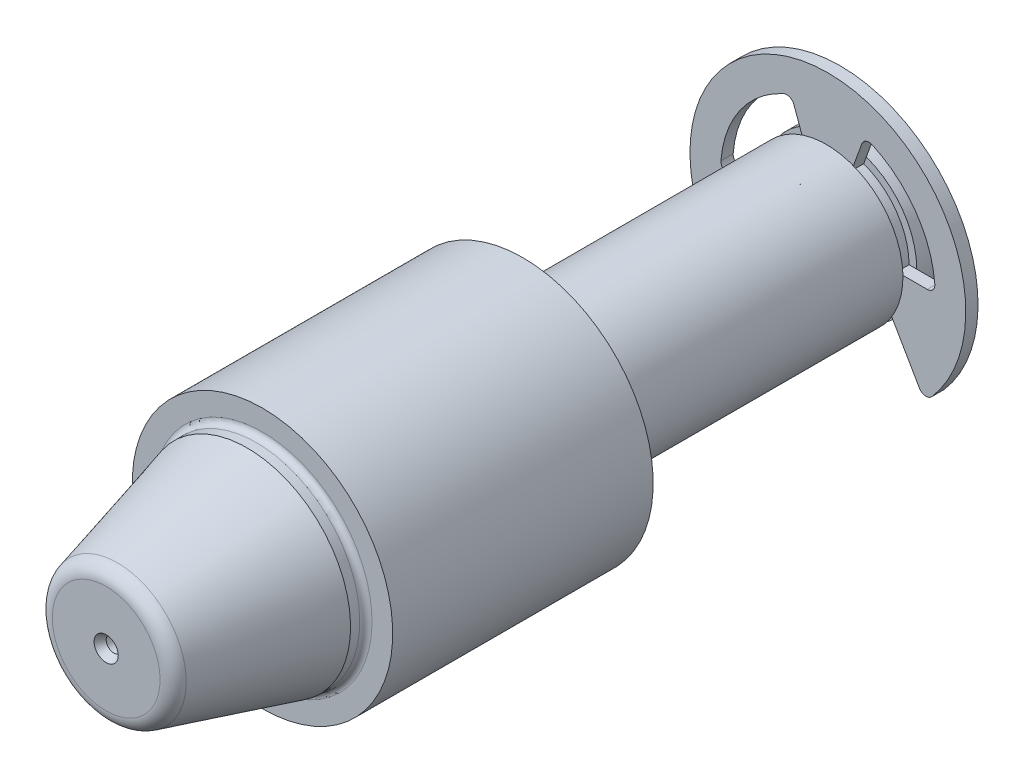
ISO-10303-21;
HEADER;
FILE_DESCRIPTION(('STEP AP214'),'2;1');
FILE_NAME('part.step','',(''),(''),'','','');
FILE_SCHEMA(('AUTOMOTIVE_DESIGN { 1 0 10303 214 1 1 1 1 }'));
ENDSEC;
DATA;
#1=APPLICATION_CONTEXT('core data for automotive mechanical design processes');
#2=APPLICATION_PROTOCOL_DEFINITION('international standard','automotive_design',2000,#1);
#3=PRODUCT_CONTEXT('',#1,'mechanical');
#4=PRODUCT('Part','Part','',(#3));
#5=PRODUCT_RELATED_PRODUCT_CATEGORY('part','',(#4));
#6=PRODUCT_DEFINITION_FORMATION('','',#4);
#7=PRODUCT_DEFINITION_CONTEXT('part definition',#1,'design');
#8=PRODUCT_DEFINITION('design','',#6,#7);
#9=PRODUCT_DEFINITION_SHAPE('','',#8);
#10=(LENGTH_UNIT() NAMED_UNIT(*) SI_UNIT(.MILLI.,.METRE.));
#11=(NAMED_UNIT(*) PLANE_ANGLE_UNIT() SI_UNIT($,.RADIAN.));
#12=(NAMED_UNIT(*) SI_UNIT($,.STERADIAN.) SOLID_ANGLE_UNIT());
#13=UNCERTAINTY_MEASURE_WITH_UNIT(LENGTH_MEASURE(1.E-05),#10,'distance_accuracy_value','');
#14=(GEOMETRIC_REPRESENTATION_CONTEXT(3) GLOBAL_UNCERTAINTY_ASSIGNED_CONTEXT((#13)) GLOBAL_UNIT_ASSIGNED_CONTEXT((#10,
#11,#12)) REPRESENTATION_CONTEXT('',''));
#15=CARTESIAN_POINT('',(0.,0.,0.));
#16=DIRECTION('',(0.,0.,1.));
#17=DIRECTION('',(1.,0.,0.));
#18=AXIS2_PLACEMENT_3D('',#15,#16,#17);
#19=CARTESIAN_POINT('',(0.,0.,26.2));
#20=DIRECTION('',(0.,0.,-1.));
#21=DIRECTION('',(0.,-1.,0.));
#22=AXIS2_PLACEMENT_3D('',#19,#20,#21);
#23=TOROIDAL_SURFACE('',#22,3.51754044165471,1.);
#24=CARTESIAN_POINT('',(0.,0.,26.4588190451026));
#25=DIRECTION('',(0.,0.,-1.));
#26=DIRECTION('',(0.,-1.,0.));
#27=AXIS2_PLACEMENT_3D('',#24,#25,#26);
#28=CIRCLE('',#27,4.48346626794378);
#29=CARTESIAN_POINT('',(0.,-4.48346626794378,26.4588190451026));
#30=VERTEX_POINT('',#29);
#31=EDGE_CURVE('E186',#30,#30,#28,.T.);
#32=ORIENTED_EDGE('',*,*,#31,.F.);
#33=EDGE_LOOP('',(#32));
#34=FACE_BOUND('',#33,.T.);
#35=CARTESIAN_POINT('',(0.,0.,27.2));
#36=DIRECTION('',(0.,0.,-1.));
#37=DIRECTION('',(0.,-1.,0.));
#38=AXIS2_PLACEMENT_3D('',#35,#36,#37);
#39=CIRCLE('',#38,3.51754044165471);
#40=CARTESIAN_POINT('',(0.,-3.51754044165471,27.2));
#41=VERTEX_POINT('',#40);
#42=EDGE_CURVE('E190',#41,#41,#39,.T.);
#43=ORIENTED_EDGE('',*,*,#42,.T.);
#44=EDGE_LOOP('',(#43));
#45=FACE_BOUND('',#44,.T.);
#46=ADVANCED_FACE('F14',(#34,#45),#23,.T.);
#47=CARTESIAN_POINT('',(0.,0.,26.4588190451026));
#48=DIRECTION('',(0.,0.,-1.));
#49=DIRECTION('',(0.,-1.,0.));
#50=AXIS2_PLACEMENT_3D('',#47,#48,#49);
#51=CONICAL_SURFACE('',#50,4.48346626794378,0.26179938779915);
#52=CARTESIAN_POINT('',(0.,0.,18.));
#53=DIRECTION('',(0.,0.,-1.));
#54=DIRECTION('',(0.,-1.,0.));
#55=AXIS2_PLACEMENT_3D('',#52,#53,#54);
#56=CIRCLE('',#55,6.75);
#57=CARTESIAN_POINT('',(0.,-6.75,18.));
#58=VERTEX_POINT('',#57);
#59=EDGE_CURVE('E399',#58,#58,#56,.T.);
#60=ORIENTED_EDGE('',*,*,#59,.F.);
#61=EDGE_LOOP('',(#60));
#62=FACE_BOUND('',#61,.T.);
#63=ORIENTED_EDGE('',*,*,#31,.T.);
#64=EDGE_LOOP('',(#63));
#65=FACE_BOUND('',#64,.T.);
#66=ADVANCED_FACE('F405',(#62,#65),#51,.T.);
#67=CARTESIAN_POINT('',(0.,3.51754044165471,27.2));
#68=DIRECTION('',(0.,0.,-1.));
#69=DIRECTION('',(0.,-1.,0.));
#70=AXIS2_PLACEMENT_3D('',#67,#68,#69);
#71=PLANE('',#70);
#72=CARTESIAN_POINT('',(0.,0.,27.2));
#73=DIRECTION('',(0.,0.,-1.));
#74=DIRECTION('',(0.,-1.,0.));
#75=AXIS2_PLACEMENT_3D('',#72,#73,#74);
#76=CIRCLE('',#75,0.788675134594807);
#77=CARTESIAN_POINT('',(0.,-0.788675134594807,27.2));
#78=VERTEX_POINT('',#77);
#79=EDGE_CURVE('E201',#78,#78,#76,.T.);
#80=ORIENTED_EDGE('',*,*,#79,.T.);
#81=EDGE_LOOP('',(#80));
#82=FACE_BOUND('',#81,.T.);
#83=ORIENTED_EDGE('',*,*,#42,.F.);
#84=EDGE_LOOP('',(#83));
#85=FACE_BOUND('',#84,.T.);
#86=ADVANCED_FACE('F413',(#82,#85),#71,.F.);
#87=CARTESIAN_POINT('',(0.,0.,-23.6077483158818));
#88=DIRECTION('',(0.,0.,-1.));
#89=DIRECTION('',(0.,-1.,0.));
#90=AXIS2_PLACEMENT_3D('',#87,#88,#89);
#91=CYLINDRICAL_SURFACE('',#90,6.75);
#92=CARTESIAN_POINT('',(0.,0.,17.4));
#93=DIRECTION('',(0.,0.,-1.));
#94=DIRECTION('',(0.,-1.,0.));
#95=AXIS2_PLACEMENT_3D('',#92,#93,#94);
#96=CIRCLE('',#95,6.75);
#97=CARTESIAN_POINT('',(0.,-6.75,17.4));
#98=VERTEX_POINT('',#97);
#99=EDGE_CURVE('E213',#98,#98,#96,.F.);
#100=ORIENTED_EDGE('',*,*,#99,.T.);
#101=EDGE_LOOP('',(#100));
#102=FACE_BOUND('',#101,.T.);
#103=ORIENTED_EDGE('',*,*,#59,.T.);
#104=EDGE_LOOP('',(#103));
#105=FACE_BOUND('',#104,.T.);
#106=ADVANCED_FACE('F415',(#102,#105),#91,.T.);
#107=CARTESIAN_POINT('',(0.,0.,26.7));
#108=DIRECTION('',(0.,0.,1.));
#109=DIRECTION('',(0.,1.,0.));
#110=AXIS2_PLACEMENT_3D('',#107,#108,#109);
#111=CONICAL_SURFACE('',#110,0.5,0.523598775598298);
#112=ORIENTED_EDGE('',*,*,#79,.F.);
#113=EDGE_LOOP('',(#112));
#114=FACE_BOUND('',#113,.T.);
#115=CARTESIAN_POINT('',(0.,0.,26.7));
#116=DIRECTION('',(0.,0.,-1.));
#117=DIRECTION('',(0.,-1.,0.));
#118=AXIS2_PLACEMENT_3D('',#115,#116,#117);
#119=CIRCLE('',#118,0.5);
#120=CARTESIAN_POINT('',(0.,-0.5,26.7));
#121=VERTEX_POINT('',#120);
#122=EDGE_CURVE('E198',#121,#121,#119,.F.);
#123=ORIENTED_EDGE('',*,*,#122,.F.);
#124=EDGE_LOOP('',(#123));
#125=FACE_BOUND('',#124,.T.);
#126=ADVANCED_FACE('F424',(#114,#125),#111,.F.);
#127=CARTESIAN_POINT('',(0.,0.,17.4));
#128=DIRECTION('',(0.,0.,-1.));
#129=DIRECTION('',(0.,-1.,0.));
#130=AXIS2_PLACEMENT_3D('',#127,#128,#129);
#131=TOROIDAL_SURFACE('',#130,7.15,0.4);
#132=ORIENTED_EDGE('',*,*,#99,.F.);
#133=EDGE_LOOP('',(#132));
#134=FACE_BOUND('',#133,.T.);
#135=CARTESIAN_POINT('',(0.,0.,17.));
#136=DIRECTION('',(0.,0.,-1.));
#137=DIRECTION('',(0.,-1.,0.));
#138=AXIS2_PLACEMENT_3D('',#135,#136,#137);
#139=CIRCLE('',#138,7.15);
#140=CARTESIAN_POINT('',(0.,-7.15,17.));
#141=VERTEX_POINT('',#140);
#142=EDGE_CURVE('E210',#141,#141,#139,.T.);
#143=ORIENTED_EDGE('',*,*,#142,.F.);
#144=EDGE_LOOP('',(#143));
#145=FACE_BOUND('',#144,.T.);
#146=ADVANCED_FACE('F793',(#134,#145),#131,.F.);
#147=CARTESIAN_POINT('',(0.,0.,17.2));
#148=DIRECTION('',(0.,0.,1.));
#149=DIRECTION('',(0.,1.,0.));
#150=AXIS2_PLACEMENT_3D('',#147,#148,#149);
#151=CYLINDRICAL_SURFACE('',#150,0.5);
#152=ORIENTED_EDGE('',*,*,#122,.T.);
#153=EDGE_LOOP('',(#152));
#154=FACE_BOUND('',#153,.T.);
#155=CARTESIAN_POINT('',(0.,0.,23.5317642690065));
#156=DIRECTION('',(0.,0.,-1.));
#157=DIRECTION('',(0.,-1.,0.));
#158=AXIS2_PLACEMENT_3D('',#155,#156,#157);
#159=CIRCLE('',#158,0.5);
#160=CARTESIAN_POINT('',(0.,-0.50000000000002,23.5317642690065));
#161=VERTEX_POINT('',#160);
#162=EDGE_CURVE('E175',#161,#161,#159,.F.);
#163=ORIENTED_EDGE('',*,*,#162,.F.);
#164=EDGE_LOOP('',(#163));
#165=FACE_BOUND('',#164,.T.);
#166=ADVANCED_FACE('F583',(#154,#165),#151,.F.);
#167=CARTESIAN_POINT('',(0.,6.75,17.));
#168=DIRECTION('',(0.,0.,-1.));
#169=DIRECTION('',(0.,-1.,0.));
#170=AXIS2_PLACEMENT_3D('',#167,#168,#169);
#171=PLANE('',#170);
#172=ORIENTED_EDGE('',*,*,#142,.T.);
#173=EDGE_LOOP('',(#172));
#174=FACE_BOUND('',#173,.T.);
#175=CARTESIAN_POINT('',(0.,0.,17.));
#176=DIRECTION('',(0.,0.,-1.));
#177=DIRECTION('',(0.,-1.,0.));
#178=AXIS2_PLACEMENT_3D('',#175,#176,#177);
#179=CIRCLE('',#178,8.5);
#180=CARTESIAN_POINT('',(0.,-8.5,17.));
#181=VERTEX_POINT('',#180);
#182=EDGE_CURVE('E396',#181,#181,#179,.T.);
#183=ORIENTED_EDGE('',*,*,#182,.F.);
#184=EDGE_LOOP('',(#183));
#185=FACE_BOUND('',#184,.T.);
#186=ADVANCED_FACE('F574',(#174,#185),#171,.F.);
#187=CARTESIAN_POINT('',(0.,0.,22.3));
#188=DIRECTION('',(0.,0.,-1.));
#189=DIRECTION('',(0.,-1.,0.));
#190=AXIS2_PLACEMENT_3D('',#187,#188,#189);
#191=CONICAL_SURFACE('',#190,2.55,1.02974425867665);
#192=CARTESIAN_POINT('',(0.,0.,22.3));
#193=DIRECTION('',(0.,0.,-1.));
#194=DIRECTION('',(0.,-1.,0.));
#195=AXIS2_PLACEMENT_3D('',#192,#193,#194);
#196=CIRCLE('',#195,2.55);
#197=CARTESIAN_POINT('',(0.,-2.55,22.3));
#198=VERTEX_POINT('',#197);
#199=EDGE_CURVE('E181',#198,#198,#196,.T.);
#200=CARTESIAN_POINT('',(0.,-0.50000000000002,23.5317642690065));
#201=CARTESIAN_POINT('',(0.,-0.521354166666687,23.5189333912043));
#202=CARTESIAN_POINT('',(0.,-0.542708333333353,23.5061025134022));
#203=CARTESIAN_POINT('',(0.,-0.585416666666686,23.4804407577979));
#204=CARTESIAN_POINT('',(0.,-0.606770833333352,23.4676098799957));
#205=CARTESIAN_POINT('',(0.,-0.649479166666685,23.4419481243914));
#206=CARTESIAN_POINT('',(0.,-0.670833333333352,23.4291172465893));
#207=CARTESIAN_POINT('',(0.,-0.713541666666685,23.403455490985));
#208=CARTESIAN_POINT('',(0.,-0.734895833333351,23.3906246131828));
#209=CARTESIAN_POINT('',(0.,-0.777604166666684,23.3649628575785));
#210=CARTESIAN_POINT('',(0.,-0.79895833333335,23.3521319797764));
#211=CARTESIAN_POINT('',(0.,-0.841666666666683,23.3264702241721));
#212=CARTESIAN_POINT('',(0.,-0.86302083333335,23.3136393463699));
#213=CARTESIAN_POINT('',(0.,-0.905729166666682,23.2879775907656));
#214=CARTESIAN_POINT('',(0.,-0.927083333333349,23.2751467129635));
#215=CARTESIAN_POINT('',(0.,-0.969791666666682,23.2494849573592));
#216=CARTESIAN_POINT('',(0.,-0.991145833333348,23.236654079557));
#217=CARTESIAN_POINT('',(0.,-1.03385416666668,23.2109923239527));
#218=CARTESIAN_POINT('',(0.,-1.05520833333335,23.1981614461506));
#219=CARTESIAN_POINT('',(0.,-1.09791666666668,23.1724996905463));
#220=CARTESIAN_POINT('',(0.,-1.11927083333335,23.1596688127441));
#221=CARTESIAN_POINT('',(0.,-1.16197916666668,23.1340070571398));
#222=CARTESIAN_POINT('',(0.,-1.18333333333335,23.1211761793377));
#223=CARTESIAN_POINT('',(0.,-1.22604166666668,23.0955144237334));
#224=CARTESIAN_POINT('',(0.,-1.24739583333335,23.0826835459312));
#225=CARTESIAN_POINT('',(0.,-1.29010416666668,23.0570217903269));
#226=CARTESIAN_POINT('',(0.,-1.31145833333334,23.0441909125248));
#227=CARTESIAN_POINT('',(0.,-1.35416666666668,23.0185291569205));
#228=CARTESIAN_POINT('',(0.,-1.37552083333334,23.0056982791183));
#229=CARTESIAN_POINT('',(0.,-1.41822916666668,22.980036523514));
#230=CARTESIAN_POINT('',(0.,-1.43958333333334,22.9672056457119));
#231=CARTESIAN_POINT('',(0.,-1.48229166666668,22.9415438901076));
#232=CARTESIAN_POINT('',(0.,-1.50364583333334,22.9287130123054));
#233=CARTESIAN_POINT('',(0.,-1.54635416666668,22.9030512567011));
#234=CARTESIAN_POINT('',(0.,-1.56770833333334,22.8902203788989));
#235=CARTESIAN_POINT('',(0.,-1.61041666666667,22.8645586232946));
#236=CARTESIAN_POINT('',(0.,-1.63177083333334,22.8517277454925));
#237=CARTESIAN_POINT('',(0.,-1.67447916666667,22.8260659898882));
#238=CARTESIAN_POINT('',(0.,-1.69583333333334,22.813235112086));
#239=CARTESIAN_POINT('',(0.,-1.73854166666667,22.7875733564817));
#240=CARTESIAN_POINT('',(0.,-1.75989583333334,22.7747424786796));
#241=CARTESIAN_POINT('',(0.,-1.80260416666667,22.7490807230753));
#242=CARTESIAN_POINT('',(0.,-1.82395833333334,22.7362498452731));
#243=CARTESIAN_POINT('',(0.,-1.86666666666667,22.7105880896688));
#244=CARTESIAN_POINT('',(0.,-1.88802083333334,22.6977572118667));
#245=CARTESIAN_POINT('',(0.,-1.93072916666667,22.6720954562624));
#246=CARTESIAN_POINT('',(0.,-1.95208333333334,22.6592645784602));
#247=CARTESIAN_POINT('',(0.,-1.99479166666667,22.6336028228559));
#248=CARTESIAN_POINT('',(0.,-2.01614583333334,22.6207719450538));
#249=CARTESIAN_POINT('',(0.,-2.05885416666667,22.5951101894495));
#250=CARTESIAN_POINT('',(0.,-2.08020833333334,22.5822793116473));
#251=CARTESIAN_POINT('',(0.,-2.12291666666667,22.556617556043));
#252=CARTESIAN_POINT('',(0.,-2.14427083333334,22.5437866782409));
#253=CARTESIAN_POINT('',(0.,-2.18697916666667,22.5181249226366));
#254=CARTESIAN_POINT('',(0.,-2.20833333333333,22.5052940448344));
#255=CARTESIAN_POINT('',(0.,-2.25104166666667,22.4796322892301));
#256=CARTESIAN_POINT('',(0.,-2.27239583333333,22.466801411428));
#257=CARTESIAN_POINT('',(0.,-2.31510416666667,22.4411396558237));
#258=CARTESIAN_POINT('',(0.,-2.33645833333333,22.4283087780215));
#259=CARTESIAN_POINT('',(0.,-2.37916666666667,22.4026470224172));
#260=CARTESIAN_POINT('',(0.,-2.40052083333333,22.3898161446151));
#261=CARTESIAN_POINT('',(0.,-2.44322916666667,22.3641543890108));
#262=CARTESIAN_POINT('',(0.,-2.46458333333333,22.3513235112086));
#263=CARTESIAN_POINT('',(0.,-2.50729166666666,22.3256617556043));
#264=CARTESIAN_POINT('',(0.,-2.52864583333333,22.3128308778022));
#265=CARTESIAN_POINT('',(0.,-2.55,22.3));
#266=B_SPLINE_CURVE_WITH_KNOTS('',3,(#200,#201,#202,#203,#204,#205,#206,#207,#208,#209,#210,
#211,#212,#213,#214,#215,#216,#217,#218,#219,#220,#221,#222,#223,#224,#225,#226,#227,#228,#229,
#230,#231,#232,#233,#234,#235,#236,#237,#238,#239,#240,#241,#242,#243,#244,#245,#246,#247,#248,
#249,#250,#251,#252,#253,#254,#255,#256,#257,#258,#259,#260,#261,#262,#263,#264,#265),
.UNSPECIFIED.,.F.,.F.,(4,2,2,2,2,2,2,2,2,2,2,2,2,2,2,2,2,2,2,2,2,2,2,2,2,2,2,2,2,2,2,2,4),(0.,
0.0747374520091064,0.149474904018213,0.22421235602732,0.298949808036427,0.373687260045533,
0.44842471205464,0.523162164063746,0.597899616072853,0.67263706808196,0.747374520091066,
0.822111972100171,0.896849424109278,0.971586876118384,1.04632432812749,1.1210617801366,
1.1957992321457,1.27053668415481,1.34527413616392,1.42001158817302,1.49474904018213,
1.56948649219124,1.64422394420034,1.71896139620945,1.79369884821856,1.86843630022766,
1.94317375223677,2.01791120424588,2.09264865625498,2.16738610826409,2.2421235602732,
2.3168610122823,2.39159846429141),.UNSPECIFIED.);
#267=EDGE_CURVE('BSEAM572',#161,#198,#266,.T.);
#268=ORIENTED_EDGE('',*,*,#162,.T.);
#269=ORIENTED_EDGE('',*,*,#199,.T.);
#270=ORIENTED_EDGE('',*,*,#267,.T.);
#271=ORIENTED_EDGE('',*,*,#267,.F.);
#272=EDGE_LOOP('',(#268,#270,#269,#271));
#273=FACE_BOUND('',#272,.T.);
#274=ADVANCED_FACE('F572',(#273),#191,.F.);
#275=CARTESIAN_POINT('',(0.,0.,-23.6077483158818));
#276=DIRECTION('',(0.,0.,-1.));
#277=DIRECTION('',(0.,-1.,0.));
#278=AXIS2_PLACEMENT_3D('',#275,#276,#277);
#279=CYLINDRICAL_SURFACE('',#278,8.5);
#280=CARTESIAN_POINT('',(0.,0.,0.));
#281=DIRECTION('',(0.,0.,-1.));
#282=DIRECTION('',(0.,-1.,0.));
#283=AXIS2_PLACEMENT_3D('',#280,#281,#282);
#284=CIRCLE('',#283,8.5);
#285=CARTESIAN_POINT('',(0.,-8.5,0.));
#286=VERTEX_POINT('',#285);
#287=EDGE_CURVE('E393',#286,#286,#284,.T.);
#288=ORIENTED_EDGE('',*,*,#287,.F.);
#289=EDGE_LOOP('',(#288));
#290=FACE_BOUND('',#289,.T.);
#291=ORIENTED_EDGE('',*,*,#182,.T.);
#292=EDGE_LOOP('',(#291));
#293=FACE_BOUND('',#292,.T.);
#294=ADVANCED_FACE('F568',(#290,#293),#279,.T.);
#295=CARTESIAN_POINT('',(0.,0.,-22.7));
#296=DIRECTION('',(0.,0.,-1.));
#297=DIRECTION('',(0.,-1.,0.));
#298=AXIS2_PLACEMENT_3D('',#295,#296,#297);
#299=CYLINDRICAL_SURFACE('',#298,2.55);
#300=CARTESIAN_POINT('',(0.,0.,-22.2));
#301=DIRECTION('',(0.,0.,1.));
#302=DIRECTION('',(0.,1.,0.));
#303=AXIS2_PLACEMENT_3D('',#300,#301,#302);
#304=CIRCLE('',#303,2.55);
#305=CARTESIAN_POINT('',(0.,2.55,-22.2));
#306=VERTEX_POINT('',#305);
#307=EDGE_CURVE('E192',#306,#306,#304,.F.);
#308=ORIENTED_EDGE('',*,*,#307,.T.);
#309=EDGE_LOOP('',(#308));
#310=FACE_BOUND('',#309,.T.);
#311=ORIENTED_EDGE('',*,*,#199,.F.);
#312=EDGE_LOOP('',(#311));
#313=FACE_BOUND('',#312,.T.);
#314=ADVANCED_FACE('F565',(#310,#313),#299,.F.);
#315=CARTESIAN_POINT('',(0.,5.,0.));
#316=DIRECTION('',(0.,0.,1.));
#317=DIRECTION('',(0.,1.,0.));
#318=AXIS2_PLACEMENT_3D('',#315,#316,#317);
#319=PLANE('',#318);
#320=CARTESIAN_POINT('',(0.,0.,0.));
#321=DIRECTION('',(0.,0.,1.));
#322=DIRECTION('',(0.,1.,0.));
#323=AXIS2_PLACEMENT_3D('',#320,#321,#322);
#324=CIRCLE('',#323,5.4);
#325=CARTESIAN_POINT('',(0.,5.4,0.));
#326=VERTEX_POINT('',#325);
#327=EDGE_CURVE('E207',#326,#326,#324,.T.);
#328=ORIENTED_EDGE('',*,*,#327,.T.);
#329=EDGE_LOOP('',(#328));
#330=FACE_BOUND('',#329,.T.);
#331=ORIENTED_EDGE('',*,*,#287,.T.);
#332=EDGE_LOOP('',(#331));
#333=FACE_BOUND('',#332,.T.);
#334=ADVANCED_FACE('F561',(#330,#333),#319,.F.);
#335=CARTESIAN_POINT('',(0.,0.,-22.2));
#336=DIRECTION('',(0.,0.,-1.));
#337=DIRECTION('',(0.,-1.,0.));
#338=AXIS2_PLACEMENT_3D('',#335,#336,#337);
#339=CONICAL_SURFACE('',#338,2.55,0.523598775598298);
#340=CARTESIAN_POINT('',(0.,0.,-22.7));
#341=DIRECTION('',(0.,0.,1.));
#342=DIRECTION('',(0.,1.,0.));
#343=AXIS2_PLACEMENT_3D('',#340,#341,#342);
#344=CIRCLE('',#343,2.8386751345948);
#345=CARTESIAN_POINT('',(0.,2.8386751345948,-22.7));
#346=VERTEX_POINT('',#345);
#347=EDGE_CURVE('E195',#346,#346,#344,.T.);
#348=ORIENTED_EDGE('',*,*,#347,.F.);
#349=EDGE_LOOP('',(#348));
#350=FACE_BOUND('',#349,.T.);
#351=ORIENTED_EDGE('',*,*,#307,.F.);
#352=EDGE_LOOP('',(#351));
#353=FACE_BOUND('',#352,.T.);
#354=ADVANCED_FACE('F552',(#350,#353),#339,.F.);
#355=CARTESIAN_POINT('',(0.,0.,-0.4));
#356=DIRECTION('',(0.,0.,1.));
#357=DIRECTION('',(0.,1.,0.));
#358=AXIS2_PLACEMENT_3D('',#355,#356,#357);
#359=TOROIDAL_SURFACE('',#358,5.4,0.4);
#360=ORIENTED_EDGE('',*,*,#327,.F.);
#361=EDGE_LOOP('',(#360));
#362=FACE_BOUND('',#361,.T.);
#363=CARTESIAN_POINT('',(0.,0.,-0.4));
#364=DIRECTION('',(0.,0.,1.));
#365=DIRECTION('',(0.,1.,0.));
#366=AXIS2_PLACEMENT_3D('',#363,#364,#365);
#367=CIRCLE('',#366,5.);
#368=CARTESIAN_POINT('',(0.,5.,-0.4));
#369=VERTEX_POINT('',#368);
#370=EDGE_CURVE('E204',#369,#369,#367,.F.);
#371=ORIENTED_EDGE('',*,*,#370,.F.);
#372=EDGE_LOOP('',(#371));
#373=FACE_BOUND('',#372,.T.);
#374=ADVANCED_FACE('F543',(#362,#373),#359,.F.);
#375=CARTESIAN_POINT('',(0.,0.,-22.7));
#376=DIRECTION('',(0.,0.,1.));
#377=DIRECTION('',(0.,1.,0.));
#378=AXIS2_PLACEMENT_3D('',#375,#376,#377);
#379=PLANE('',#378);
#380=CARTESIAN_POINT('',(0.,0.,-22.7));
#381=DIRECTION('',(0.,0.,1.));
#382=DIRECTION('',(0.,1.,0.));
#383=AXIS2_PLACEMENT_3D('',#380,#381,#382);
#384=CIRCLE('',#383,4.5);
#385=CARTESIAN_POINT('',(0.,4.5,-22.7));
#386=VERTEX_POINT('',#385);
#387=EDGE_CURVE('E216',#386,#386,#384,.F.);
#388=ORIENTED_EDGE('',*,*,#387,.T.);
#389=EDGE_LOOP('',(#388));
#390=FACE_BOUND('',#389,.T.);
#391=ORIENTED_EDGE('',*,*,#347,.T.);
#392=EDGE_LOOP('',(#391));
#393=FACE_BOUND('',#392,.T.);
#394=ADVANCED_FACE('F541',(#390,#393),#379,.F.);
#395=CARTESIAN_POINT('',(0.,0.,-23.6077483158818));
#396=DIRECTION('',(0.,0.,-1.));
#397=DIRECTION('',(0.,-1.,0.));
#398=AXIS2_PLACEMENT_3D('',#395,#396,#397);
#399=CYLINDRICAL_SURFACE('',#398,5.);
#400=ORIENTED_EDGE('',*,*,#370,.T.);
#401=EDGE_LOOP('',(#400));
#402=FACE_BOUND('',#401,.T.);
#403=CARTESIAN_POINT('',(0.,0.,-19.8));
#404=DIRECTION('',(0.,0.,-1.));
#405=DIRECTION('',(0.,-1.,0.));
#406=AXIS2_PLACEMENT_3D('',#403,#404,#405);
#407=CIRCLE('',#406,5.);
#408=CARTESIAN_POINT('',(0.,-5.,-19.8));
#409=VERTEX_POINT('',#408);
#410=EDGE_CURVE('E390',#409,#409,#407,.T.);
#411=ORIENTED_EDGE('',*,*,#410,.F.);
#412=EDGE_LOOP('',(#411));
#413=FACE_BOUND('',#412,.T.);
#414=ADVANCED_FACE('F539',(#402,#413),#399,.T.);
#415=CARTESIAN_POINT('',(0.,0.,-22.7));
#416=DIRECTION('',(0.,0.,1.));
#417=DIRECTION('',(0.,1.,0.));
#418=AXIS2_PLACEMENT_3D('',#415,#416,#417);
#419=CONICAL_SURFACE('',#418,4.5,0.785398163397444);
#420=CARTESIAN_POINT('',(0.,0.,-22.2));
#421=DIRECTION('',(0.,0.,1.));
#422=DIRECTION('',(0.,1.,0.));
#423=AXIS2_PLACEMENT_3D('',#420,#421,#422);
#424=CIRCLE('',#423,5.);
#425=CARTESIAN_POINT('',(0.,5.,-22.2));
#426=VERTEX_POINT('',#425);
#427=EDGE_CURVE('E219',#426,#426,#424,.T.);
#428=ORIENTED_EDGE('',*,*,#427,.F.);
#429=EDGE_LOOP('',(#428));
#430=FACE_BOUND('',#429,.T.);
#431=ORIENTED_EDGE('',*,*,#387,.F.);
#432=EDGE_LOOP('',(#431));
#433=FACE_BOUND('',#432,.T.);
#434=ADVANCED_FACE('F445',(#430,#433),#419,.T.);
#435=CARTESIAN_POINT('',(0.,0.,-23.6077483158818));
#436=DIRECTION('',(0.,0.,-1.));
#437=DIRECTION('',(0.,-1.,0.));
#438=AXIS2_PLACEMENT_3D('',#435,#436,#437);
#439=CYLINDRICAL_SURFACE('',#438,5.);
#440=ORIENTED_EDGE('',*,*,#427,.T.);
#441=EDGE_LOOP('',(#440));
#442=FACE_BOUND('',#441,.T.);
#443=CARTESIAN_POINT('',(0.,0.,-20.7));
#444=DIRECTION('',(0.,0.,-1.));
#445=DIRECTION('',(0.,-1.,0.));
#446=AXIS2_PLACEMENT_3D('',#443,#444,#445);
#447=CIRCLE('',#446,5.);
#448=CARTESIAN_POINT('',(-4.18419829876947,-2.73724032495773,-20.7));
#449=VERTEX_POINT('',#448);
#450=CARTESIAN_POINT('',(-5.,0.,-20.7));
#451=VERTEX_POINT('',#450);
#452=EDGE_CURVE('E324',#449,#451,#447,.T.);
#453=ORIENTED_EDGE('',*,*,#452,.T.);
#454=CARTESIAN_POINT('',(-1.71010071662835,4.69846310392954,-20.7));
#455=VERTEX_POINT('',#454);
#456=EDGE_CURVE('E365',#451,#455,#447,.T.);
#457=ORIENTED_EDGE('',*,*,#456,.T.);
#458=CARTESIAN_POINT('',(1.71010071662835,4.69846310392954,-20.7));
#459=VERTEX_POINT('',#458);
#460=EDGE_CURVE('E360',#455,#459,#447,.T.);
#461=ORIENTED_EDGE('',*,*,#460,.T.);
#462=CARTESIAN_POINT('',(5.,0.,-20.7));
#463=VERTEX_POINT('',#462);
#464=EDGE_CURVE('E363',#459,#463,#447,.T.);
#465=ORIENTED_EDGE('',*,*,#464,.T.);
#466=CARTESIAN_POINT('',(4.18419829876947,-2.73724032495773,-20.7));
#467=VERTEX_POINT('',#466);
#468=EDGE_CURVE('E379',#463,#467,#447,.T.);
#469=ORIENTED_EDGE('',*,*,#468,.T.);
#470=EDGE_CURVE('E380',#467,#449,#447,.T.);
#471=ORIENTED_EDGE('',*,*,#470,.T.);
#472=EDGE_LOOP('',(#453,#457,#461,#465,#469,#471));
#473=FACE_BOUND('',#472,.T.);
#474=ADVANCED_FACE('F361',(#442,#473),#439,.T.);
#475=CARTESIAN_POINT('',(0.,4.5,-20.7));
#476=DIRECTION('',(0.,0.,-1.));
#477=DIRECTION('',(0.,-1.,0.));
#478=AXIS2_PLACEMENT_3D('',#475,#476,#477);
#479=PLANE('',#478);
#480=DIRECTION('',(-1.,0.,0.));
#481=VECTOR('',#480,1.);
#482=CARTESIAN_POINT('',(0.,0.,-20.7));
#483=LINE('',#482,#481);
#484=CARTESIAN_POINT('',(4.5,0.,-20.7));
#485=VERTEX_POINT('',#484);
#486=EDGE_CURVE('E9',#463,#485,#483,.T.);
#487=ORIENTED_EDGE('',*,*,#486,.F.);
#488=ORIENTED_EDGE('',*,*,#464,.F.);
#489=DIRECTION('',(0.342020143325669,0.939692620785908,0.));
#490=VECTOR('',#489,1.);
#491=CARTESIAN_POINT('',(1.44627212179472,3.9735999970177,-20.7));
#492=LINE('',#491,#490);
#493=CARTESIAN_POINT('',(1.53909064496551,4.22861679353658,-20.7));
#494=VERTEX_POINT('',#493);
#495=EDGE_CURVE('E24',#494,#459,#492,.T.);
#496=ORIENTED_EDGE('',*,*,#495,.F.);
#497=CARTESIAN_POINT('',(0.,0.,-20.7));
#498=DIRECTION('',(0.,0.,-1.));
#499=DIRECTION('',(0.,-1.,0.));
#500=AXIS2_PLACEMENT_3D('',#497,#498,#499);
#501=CIRCLE('',#500,4.5);
#502=EDGE_CURVE('E385',#494,#485,#501,.T.);
#503=ORIENTED_EDGE('',*,*,#502,.T.);
#504=EDGE_LOOP('',(#487,#488,#496,#503));
#505=FACE_BOUND('',#504,.T.);
#506=ADVANCED_FACE('F377',(#505),#479,.F.);
#507=DIRECTION('',(0.5,0.866025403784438,0.));
#508=VECTOR('',#507,1.);
#509=CARTESIAN_POINT('',(-0.00433173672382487,4.50250092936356,-20.7));
#510=LINE('',#509,#508);
#511=CARTESIAN_POINT('',(-3.9,-2.24499443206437,-20.7));
#512=VERTEX_POINT('',#511);
#513=EDGE_CURVE('E244',#449,#512,#510,.T.);
#514=ORIENTED_EDGE('',*,*,#513,.F.);
#515=ORIENTED_EDGE('',*,*,#470,.F.);
#516=DIRECTION('',(0.5,-0.866025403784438,0.));
#517=VECTOR('',#516,1.);
#518=CARTESIAN_POINT('',(0.00433173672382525,4.50250092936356,-20.7));
#519=LINE('',#518,#517);
#520=CARTESIAN_POINT('',(3.9,-2.24499443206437,-20.7));
#521=VERTEX_POINT('',#520);
#522=EDGE_CURVE('E33',#521,#467,#519,.T.);
#523=ORIENTED_EDGE('',*,*,#522,.F.);
#524=EDGE_CURVE('E382',#521,#512,#501,.T.);
#525=ORIENTED_EDGE('',*,*,#524,.T.);
#526=EDGE_LOOP('',(#514,#515,#523,#525));
#527=FACE_BOUND('',#526,.T.);
#528=ADVANCED_FACE('F509',(#527),#479,.F.);
#529=DIRECTION('',(0.342020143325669,-0.939692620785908,0.));
#530=VECTOR('',#529,1.);
#531=CARTESIAN_POINT('',(-1.44627212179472,3.9735999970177,-20.7));
#532=LINE('',#531,#530);
#533=CARTESIAN_POINT('',(-1.53909064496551,4.22861679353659,-20.7));
#534=VERTEX_POINT('',#533);
#535=EDGE_CURVE('E250',#455,#534,#532,.T.);
#536=ORIENTED_EDGE('',*,*,#535,.F.);
#537=ORIENTED_EDGE('',*,*,#456,.F.);
#538=DIRECTION('',(-1.,0.,0.));
#539=VECTOR('',#538,1.);
#540=CARTESIAN_POINT('',(0.,0.,-20.7));
#541=LINE('',#540,#539);
#542=CARTESIAN_POINT('',(-4.5,0.,-20.7));
#543=VERTEX_POINT('',#542);
#544=EDGE_CURVE('E247',#543,#451,#541,.T.);
#545=ORIENTED_EDGE('',*,*,#544,.F.);
#546=EDGE_CURVE('E387',#543,#534,#501,.T.);
#547=ORIENTED_EDGE('',*,*,#546,.T.);
#548=EDGE_LOOP('',(#536,#537,#545,#547));
#549=FACE_BOUND('',#548,.T.);
#550=ADVANCED_FACE('F518',(#549),#479,.F.);
#551=CARTESIAN_POINT('',(0.,4.5,-19.8));
#552=DIRECTION('',(0.,0.,1.));
#553=DIRECTION('',(0.,1.,0.));
#554=AXIS2_PLACEMENT_3D('',#551,#552,#553);
#555=PLANE('',#554);
#556=CARTESIAN_POINT('',(0.,0.,-19.8));
#557=DIRECTION('',(0.,0.,-1.));
#558=DIRECTION('',(0.,-1.,0.));
#559=AXIS2_PLACEMENT_3D('',#556,#557,#558);
#560=CIRCLE('',#559,4.5);
#561=CARTESIAN_POINT('',(0.,-4.5,-19.8));
#562=VERTEX_POINT('',#561);
#563=EDGE_CURVE('E386',#562,#562,#560,.T.);
#564=ORIENTED_EDGE('',*,*,#563,.F.);
#565=EDGE_LOOP('',(#564));
#566=FACE_BOUND('',#565,.T.);
#567=ORIENTED_EDGE('',*,*,#410,.T.);
#568=EDGE_LOOP('',(#567));
#569=FACE_BOUND('',#568,.T.);
#570=ADVANCED_FACE('F440',(#566,#569),#555,.F.);
#571=CARTESIAN_POINT('',(0.,0.,-23.6077483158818));
#572=DIRECTION('',(0.,0.,-1.));
#573=DIRECTION('',(0.,-1.,0.));
#574=AXIS2_PLACEMENT_3D('',#571,#572,#573);
#575=CYLINDRICAL_SURFACE('',#574,4.5);
#576=ORIENTED_EDGE('',*,*,#563,.T.);
#577=EDGE_LOOP('',(#576));
#578=FACE_BOUND('',#577,.T.);
#579=DIRECTION('',(0.,0.,-1.));
#580=VECTOR('',#579,1.);
#581=CARTESIAN_POINT('',(1.53909064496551,4.22861679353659,-23.6077483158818));
#582=LINE('',#581,#580);
#583=CARTESIAN_POINT('',(1.53909064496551,4.22861679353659,-19.9));
#584=VERTEX_POINT('',#583);
#585=EDGE_CURVE('E240',#584,#494,#582,.T.);
#586=ORIENTED_EDGE('',*,*,#585,.F.);
#587=CARTESIAN_POINT('',(0.,0.,-19.9));
#588=DIRECTION('',(0.,0.,-1.));
#589=DIRECTION('',(-1.,0.,0.));
#590=AXIS2_PLACEMENT_3D('',#587,#588,#589);
#591=CIRCLE('',#590,4.5);
#592=CARTESIAN_POINT('',(-1.53909064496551,4.22861679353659,-19.9));
#593=VERTEX_POINT('',#592);
#594=EDGE_CURVE('E226',#593,#584,#591,.T.);
#595=ORIENTED_EDGE('',*,*,#594,.F.);
#596=DIRECTION('',(0.,0.,-1.));
#597=VECTOR('',#596,1.);
#598=CARTESIAN_POINT('',(-1.53909064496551,4.22861679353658,-23.6077483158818));
#599=LINE('',#598,#597);
#600=EDGE_CURVE('E237',#534,#593,#599,.F.);
#601=ORIENTED_EDGE('',*,*,#600,.F.);
#602=ORIENTED_EDGE('',*,*,#546,.F.);
#603=DIRECTION('',(0.,0.,-1.));
#604=VECTOR('',#603,1.);
#605=CARTESIAN_POINT('',(-4.5,0.,-23.6077483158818));
#606=LINE('',#605,#604);
#607=CARTESIAN_POINT('',(-4.5,0.,-19.9));
#608=VERTEX_POINT('',#607);
#609=EDGE_CURVE('E229',#608,#543,#606,.T.);
#610=ORIENTED_EDGE('',*,*,#609,.F.);
#611=CARTESIAN_POINT('',(-3.9,-2.24499443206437,-19.9));
#612=VERTEX_POINT('',#611);
#613=EDGE_CURVE('E222',#612,#608,#591,.T.);
#614=ORIENTED_EDGE('',*,*,#613,.F.);
#615=DIRECTION('',(0.,0.,-1.));
#616=VECTOR('',#615,1.);
#617=CARTESIAN_POINT('',(-3.9,-2.24499443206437,-23.6077483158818));
#618=LINE('',#617,#616);
#619=EDGE_CURVE('E225',#512,#612,#618,.F.);
#620=ORIENTED_EDGE('',*,*,#619,.F.);
#621=ORIENTED_EDGE('',*,*,#524,.F.);
#622=DIRECTION('',(0.,0.,-1.));
#623=VECTOR('',#622,1.);
#624=CARTESIAN_POINT('',(3.9,-2.24499443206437,-23.6077483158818));
#625=LINE('',#624,#623);
#626=CARTESIAN_POINT('',(3.9,-2.24499443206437,-19.9));
#627=VERTEX_POINT('',#626);
#628=EDGE_CURVE('E232',#627,#521,#625,.T.);
#629=ORIENTED_EDGE('',*,*,#628,.F.);
#630=CARTESIAN_POINT('',(4.5,0.,-19.9));
#631=VERTEX_POINT('',#630);
#632=EDGE_CURVE('E138',#631,#627,#591,.T.);
#633=ORIENTED_EDGE('',*,*,#632,.F.);
#634=DIRECTION('',(0.,0.,-1.));
#635=VECTOR('',#634,1.);
#636=CARTESIAN_POINT('',(4.5,0.,-23.6077483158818));
#637=LINE('',#636,#635);
#638=EDGE_CURVE('E234',#485,#631,#637,.F.);
#639=ORIENTED_EDGE('',*,*,#638,.F.);
#640=ORIENTED_EDGE('',*,*,#502,.F.);
#641=EDGE_LOOP('',(#586,#595,#601,#602,#610,#614,#620,#621,#629,#633,#639,#640));
#642=FACE_BOUND('',#641,.T.);
#643=ADVANCED_FACE('F431',(#578,#642),#575,.T.);
#644=CARTESIAN_POINT('',(0.,0.,-20.7));
#645=DIRECTION('',(0.,0.,-1.));
#646=DIRECTION('',(-1.,0.,0.));
#647=AXIS2_PLACEMENT_3D('',#644,#645,#646);
#648=PLANE('',#647);
#649=ORIENTED_EDGE('',*,*,#460,.F.);
#650=DIRECTION('',(-0.342020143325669,0.939692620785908,0.));
#651=VECTOR('',#650,1.);
#652=CARTESIAN_POINT('',(-2.21654386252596,6.08990421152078,-20.7));
#653=LINE('',#652,#651);
#654=CARTESIAN_POINT('',(-2.21654386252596,6.08990421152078,-20.7));
#655=VERTEX_POINT('',#654);
#656=EDGE_CURVE('E263',#455,#655,#653,.T.);
#657=ORIENTED_EDGE('',*,*,#656,.T.);
#658=CARTESIAN_POINT('',(-2.68639017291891,5.91889413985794,-20.7));
#659=DIRECTION('',(0.,0.,1.));
#660=DIRECTION('',(1.,0.,0.));
#661=AXIS2_PLACEMENT_3D('',#658,#659,#660);
#662=CIRCLE('',#661,0.5);
#663=CARTESIAN_POINT('',(-2.89303557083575,6.37419368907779,-20.7));
#664=VERTEX_POINT('',#663);
#665=EDGE_CURVE('E265',#655,#664,#662,.T.);
#666=ORIENTED_EDGE('',*,*,#665,.T.);
#667=CARTESIAN_POINT('',(0.,0.,-20.7));
#668=DIRECTION('',(0.,0.,1.));
#669=DIRECTION('',(-1.,0.,0.));
#670=AXIS2_PLACEMENT_3D('',#667,#668,#669);
#671=CIRCLE('',#670,7.);
#672=CARTESIAN_POINT('',(-6.97925921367,0.538461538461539,-20.7));
#673=VERTEX_POINT('',#672);
#674=EDGE_CURVE('E267',#664,#673,#671,.T.);
#675=ORIENTED_EDGE('',*,*,#674,.T.);
#676=CARTESIAN_POINT('',(-6.48074069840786,0.5,-20.7));
#677=DIRECTION('',(0.,0.,1.));
#678=DIRECTION('',(-1.,0.,0.));
#679=AXIS2_PLACEMENT_3D('',#676,#677,#678);
#680=CIRCLE('',#679,0.5);
#681=CARTESIAN_POINT('',(-6.48074069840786,0.,-20.7));
#682=VERTEX_POINT('',#681);
#683=EDGE_CURVE('E269',#673,#682,#680,.T.);
#684=ORIENTED_EDGE('',*,*,#683,.T.);
#685=DIRECTION('',(1.,0.,0.));
#686=VECTOR('',#685,1.);
#687=CARTESIAN_POINT('',(-4.5,0.,-20.7));
#688=LINE('',#687,#686);
#689=EDGE_CURVE('E271',#682,#451,#688,.T.);
#690=ORIENTED_EDGE('',*,*,#689,.T.);
#691=ORIENTED_EDGE('',*,*,#452,.F.);
#692=DIRECTION('',(-0.5,-0.866025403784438,0.));
#693=VECTOR('',#692,1.);
#694=CARTESIAN_POINT('',(-3.9,-2.24499443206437,-20.7));
#695=LINE('',#694,#693);
#696=CARTESIAN_POINT('',(-5.97345989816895,-5.83633232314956,-20.7));
#697=VERTEX_POINT('',#696);
#698=EDGE_CURVE('E274',#449,#697,#695,.T.);
#699=ORIENTED_EDGE('',*,*,#698,.T.);
#700=CARTESIAN_POINT('',(-6.40647260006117,-5.58633232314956,-20.7));
#701=DIRECTION('',(0.,0.,-1.));
#702=DIRECTION('',(1.,0.,0.));
#703=AXIS2_PLACEMENT_3D('',#700,#701,#702);
#704=CIRCLE('',#703,0.5);
#705=CARTESIAN_POINT('',(-6.78332392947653,-5.91494010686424,-20.7));
#706=VERTEX_POINT('',#705);
#707=EDGE_CURVE('E276',#697,#706,#704,.T.);
#708=ORIENTED_EDGE('',*,*,#707,.T.);
#709=CARTESIAN_POINT('',(0.,0.,-20.7));
#710=DIRECTION('',(0.,0.,-1.));
#711=DIRECTION('',(-1.,0.,0.));
#712=AXIS2_PLACEMENT_3D('',#709,#710,#711);
#713=CIRCLE('',#712,9.);
#714=CARTESIAN_POINT('',(6.78332392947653,-5.91494010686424,-20.7));
#715=VERTEX_POINT('',#714);
#716=EDGE_CURVE('E278',#706,#715,#713,.T.);
#717=ORIENTED_EDGE('',*,*,#716,.T.);
#718=CARTESIAN_POINT('',(6.40647260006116,-5.58633232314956,-20.7));
#719=DIRECTION('',(0.,0.,-1.));
#720=DIRECTION('',(-1.,0.,0.));
#721=AXIS2_PLACEMENT_3D('',#718,#719,#720);
#722=CIRCLE('',#721,0.5);
#723=CARTESIAN_POINT('',(5.97345989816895,-5.83633232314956,-20.7));
#724=VERTEX_POINT('',#723);
#725=EDGE_CURVE('E280',#715,#724,#722,.T.);
#726=ORIENTED_EDGE('',*,*,#725,.T.);
#727=DIRECTION('',(-0.5,0.866025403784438,0.));
#728=VECTOR('',#727,1.);
#729=CARTESIAN_POINT('',(3.9,-2.24499443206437,-20.7));
#730=LINE('',#729,#728);
#731=EDGE_CURVE('E132',#724,#467,#730,.T.);
#732=ORIENTED_EDGE('',*,*,#731,.T.);
#733=ORIENTED_EDGE('',*,*,#468,.F.);
#734=DIRECTION('',(1.,0.,0.));
#735=VECTOR('',#734,1.);
#736=CARTESIAN_POINT('',(6.48074069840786,0.,-20.7));
#737=LINE('',#736,#735);
#738=CARTESIAN_POINT('',(6.48074069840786,0.,-20.7));
#739=VERTEX_POINT('',#738);
#740=EDGE_CURVE('E139',#463,#739,#737,.T.);
#741=ORIENTED_EDGE('',*,*,#740,.T.);
#742=CARTESIAN_POINT('',(6.48074069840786,0.5,-20.7));
#743=DIRECTION('',(0.,0.,1.));
#744=DIRECTION('',(1.,0.,0.));
#745=AXIS2_PLACEMENT_3D('',#742,#743,#744);
#746=CIRCLE('',#745,0.5);
#747=CARTESIAN_POINT('',(6.97925921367,0.538461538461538,-20.7));
#748=VERTEX_POINT('',#747);
#749=EDGE_CURVE('E141',#739,#748,#746,.T.);
#750=ORIENTED_EDGE('',*,*,#749,.T.);
#751=CARTESIAN_POINT('',(0.,0.,-20.7));
#752=DIRECTION('',(0.,0.,1.));
#753=DIRECTION('',(-1.,0.,0.));
#754=AXIS2_PLACEMENT_3D('',#751,#752,#753);
#755=CIRCLE('',#754,7.);
#756=CARTESIAN_POINT('',(2.89303557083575,6.37419368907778,-20.7));
#757=VERTEX_POINT('',#756);
#758=EDGE_CURVE('E256',#748,#757,#755,.T.);
#759=ORIENTED_EDGE('',*,*,#758,.T.);
#760=CARTESIAN_POINT('',(2.68639017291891,5.91889413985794,-20.7));
#761=DIRECTION('',(0.,0.,1.));
#762=DIRECTION('',(-1.,0.,0.));
#763=AXIS2_PLACEMENT_3D('',#760,#761,#762);
#764=CIRCLE('',#763,0.5);
#765=CARTESIAN_POINT('',(2.21654386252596,6.08990421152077,-20.7));
#766=VERTEX_POINT('',#765);
#767=EDGE_CURVE('E258',#757,#766,#764,.T.);
#768=ORIENTED_EDGE('',*,*,#767,.T.);
#769=DIRECTION('',(-0.342020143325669,-0.939692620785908,0.));
#770=VECTOR('',#769,1.);
#771=CARTESIAN_POINT('',(2.21654386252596,6.08990421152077,-20.7));
#772=LINE('',#771,#770);
#773=EDGE_CURVE('E260',#766,#459,#772,.T.);
#774=ORIENTED_EDGE('',*,*,#773,.T.);
#775=EDGE_LOOP('',(#649,#657,#666,#675,#684,#690,#691,#699,#708,#717,#726,#732,#733,#741,#750,
#759,#768,#774));
#776=FACE_BOUND('',#775,.T.);
#777=ADVANCED_FACE('F319',(#776),#648,.T.);
#778=CARTESIAN_POINT('',(6.48074069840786,0.,-20.7));
#779=DIRECTION('',(0.,-1.,0.));
#780=DIRECTION('',(0.,0.,1.));
#781=AXIS2_PLACEMENT_3D('',#778,#779,#780);
#782=PLANE('',#781);
#783=DIRECTION('',(1.,0.,0.));
#784=VECTOR('',#783,1.);
#785=CARTESIAN_POINT('',(6.48074069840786,0.,-19.9));
#786=LINE('',#785,#784);
#787=CARTESIAN_POINT('',(6.48074069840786,0.,-19.9));
#788=VERTEX_POINT('',#787);
#789=EDGE_CURVE('E283',#631,#788,#786,.T.);
#790=ORIENTED_EDGE('',*,*,#789,.T.);
#791=DIRECTION('',(0.,0.,1.));
#792=VECTOR('',#791,1.);
#793=CARTESIAN_POINT('',(6.48074069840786,0.,-20.7));
#794=LINE('',#793,#792);
#795=EDGE_CURVE('E18',#739,#788,#794,.T.);
#796=ORIENTED_EDGE('',*,*,#795,.F.);
#797=ORIENTED_EDGE('',*,*,#740,.F.);
#798=ORIENTED_EDGE('',*,*,#486,.T.);
#799=ORIENTED_EDGE('',*,*,#638,.T.);
#800=EDGE_LOOP('',(#790,#796,#797,#798,#799));
#801=FACE_BOUND('',#800,.T.);
#802=ADVANCED_FACE('F16',(#801),#782,.F.);
#803=CARTESIAN_POINT('',(6.48074069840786,0.5,-20.7));
#804=DIRECTION('',(0.,0.,1.));
#805=DIRECTION('',(1.,0.,0.));
#806=AXIS2_PLACEMENT_3D('',#803,#804,#805);
#807=CYLINDRICAL_SURFACE('',#806,0.5);
#808=CARTESIAN_POINT('',(6.48074069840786,0.5,-19.9));
#809=DIRECTION('',(0.,0.,1.));
#810=DIRECTION('',(1.,0.,0.));
#811=AXIS2_PLACEMENT_3D('',#808,#809,#810);
#812=CIRCLE('',#811,0.5);
#813=CARTESIAN_POINT('',(6.97925921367,0.538461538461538,-19.9));
#814=VERTEX_POINT('',#813);
#815=EDGE_CURVE('E285',#788,#814,#812,.T.);
#816=ORIENTED_EDGE('',*,*,#815,.T.);
#817=DIRECTION('',(0.,0.,1.));
#818=VECTOR('',#817,1.);
#819=CARTESIAN_POINT('',(6.97925921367,0.538461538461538,-20.7));
#820=LINE('',#819,#818);
#821=EDGE_CURVE('E168',#748,#814,#820,.T.);
#822=ORIENTED_EDGE('',*,*,#821,.F.);
#823=ORIENTED_EDGE('',*,*,#749,.F.);
#824=ORIENTED_EDGE('',*,*,#795,.T.);
#825=EDGE_LOOP('',(#816,#822,#823,#824));
#826=FACE_BOUND('',#825,.T.);
#827=ADVANCED_FACE('F438',(#826),#807,.F.);
#828=CARTESIAN_POINT('',(0.,0.,-20.7));
#829=DIRECTION('',(0.,0.,1.));
#830=DIRECTION('',(1.,0.,0.));
#831=AXIS2_PLACEMENT_3D('',#828,#829,#830);
#832=CYLINDRICAL_SURFACE('',#831,7.);
#833=CARTESIAN_POINT('',(0.,0.,-19.9));
#834=DIRECTION('',(0.,0.,1.));
#835=DIRECTION('',(-1.,0.,0.));
#836=AXIS2_PLACEMENT_3D('',#833,#834,#835);
#837=CIRCLE('',#836,7.);
#838=CARTESIAN_POINT('',(2.89303557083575,6.37419368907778,-19.9));
#839=VERTEX_POINT('',#838);
#840=EDGE_CURVE('E287',#814,#839,#837,.T.);
#841=ORIENTED_EDGE('',*,*,#840,.T.);
#842=DIRECTION('',(0.,0.,1.));
#843=VECTOR('',#842,1.);
#844=CARTESIAN_POINT('',(2.89303557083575,6.37419368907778,-20.7));
#845=LINE('',#844,#843);
#846=EDGE_CURVE('E166',#757,#839,#845,.T.);
#847=ORIENTED_EDGE('',*,*,#846,.F.);
#848=ORIENTED_EDGE('',*,*,#758,.F.);
#849=ORIENTED_EDGE('',*,*,#821,.T.);
#850=EDGE_LOOP('',(#841,#847,#848,#849));
#851=FACE_BOUND('',#850,.T.);
#852=ADVANCED_FACE('F484',(#851),#832,.F.);
#853=CARTESIAN_POINT('',(2.68639017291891,5.91889413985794,-20.7));
#854=DIRECTION('',(0.,0.,1.));
#855=DIRECTION('',(1.,0.,0.));
#856=AXIS2_PLACEMENT_3D('',#853,#854,#855);
#857=CYLINDRICAL_SURFACE('',#856,0.5);
#858=CARTESIAN_POINT('',(2.68639017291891,5.91889413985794,-19.9));
#859=DIRECTION('',(0.,0.,1.));
#860=DIRECTION('',(-1.,0.,0.));
#861=AXIS2_PLACEMENT_3D('',#858,#859,#860);
#862=CIRCLE('',#861,0.5);
#863=CARTESIAN_POINT('',(2.21654386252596,6.08990421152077,-19.9));
#864=VERTEX_POINT('',#863);
#865=EDGE_CURVE('E289',#839,#864,#862,.T.);
#866=ORIENTED_EDGE('',*,*,#865,.T.);
#867=DIRECTION('',(0.,0.,1.));
#868=VECTOR('',#867,1.);
#869=CARTESIAN_POINT('',(2.21654386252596,6.08990421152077,-20.7));
#870=LINE('',#869,#868);
#871=EDGE_CURVE('E163',#766,#864,#870,.T.);
#872=ORIENTED_EDGE('',*,*,#871,.F.);
#873=ORIENTED_EDGE('',*,*,#767,.F.);
#874=ORIENTED_EDGE('',*,*,#846,.T.);
#875=EDGE_LOOP('',(#866,#872,#873,#874));
#876=FACE_BOUND('',#875,.T.);
#877=ADVANCED_FACE('F481',(#876),#857,.F.);
#878=CARTESIAN_POINT('',(2.21654386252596,6.08990421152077,-20.7));
#879=DIRECTION('',(-0.939692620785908,0.342020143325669,0.));
#880=DIRECTION('',(0.342020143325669,0.939692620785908,0.));
#881=AXIS2_PLACEMENT_3D('',#878,#879,#880);
#882=PLANE('',#881);
#883=DIRECTION('',(-0.342020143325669,-0.939692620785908,0.));
#884=VECTOR('',#883,1.);
#885=CARTESIAN_POINT('',(2.21654386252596,6.08990421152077,-19.9));
#886=LINE('',#885,#884);
#887=EDGE_CURVE('E291',#864,#584,#886,.T.);
#888=ORIENTED_EDGE('',*,*,#887,.T.);
#889=ORIENTED_EDGE('',*,*,#585,.T.);
#890=ORIENTED_EDGE('',*,*,#495,.T.);
#891=ORIENTED_EDGE('',*,*,#773,.F.);
#892=ORIENTED_EDGE('',*,*,#871,.T.);
#893=EDGE_LOOP('',(#888,#889,#890,#891,#892));
#894=FACE_BOUND('',#893,.T.);
#895=ADVANCED_FACE('F370',(#894),#882,.F.);
#896=CARTESIAN_POINT('',(-2.21654386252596,6.08990421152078,-20.7));
#897=DIRECTION('',(0.939692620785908,0.342020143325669,0.));
#898=DIRECTION('',(0.342020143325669,-0.939692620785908,0.));
#899=AXIS2_PLACEMENT_3D('',#896,#897,#898);
#900=PLANE('',#899);
#901=DIRECTION('',(-0.342020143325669,0.939692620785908,0.));
#902=VECTOR('',#901,1.);
#903=CARTESIAN_POINT('',(-2.21654386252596,6.08990421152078,-19.9));
#904=LINE('',#903,#902);
#905=CARTESIAN_POINT('',(-2.21654386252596,6.08990421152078,-19.9));
#906=VERTEX_POINT('',#905);
#907=EDGE_CURVE('E294',#593,#906,#904,.T.);
#908=ORIENTED_EDGE('',*,*,#907,.T.);
#909=DIRECTION('',(0.,0.,1.));
#910=VECTOR('',#909,1.);
#911=CARTESIAN_POINT('',(-2.21654386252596,6.08990421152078,-20.7));
#912=LINE('',#911,#910);
#913=EDGE_CURVE('E160',#655,#906,#912,.T.);
#914=ORIENTED_EDGE('',*,*,#913,.F.);
#915=ORIENTED_EDGE('',*,*,#656,.F.);
#916=ORIENTED_EDGE('',*,*,#535,.T.);
#917=ORIENTED_EDGE('',*,*,#600,.T.);
#918=EDGE_LOOP('',(#908,#914,#915,#916,#917));
#919=FACE_BOUND('',#918,.T.);
#920=ADVANCED_FACE('F474',(#919),#900,.F.);
#921=CARTESIAN_POINT('',(-2.68639017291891,5.91889413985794,-20.7));
#922=DIRECTION('',(0.,0.,1.));
#923=DIRECTION('',(1.,0.,0.));
#924=AXIS2_PLACEMENT_3D('',#921,#922,#923);
#925=CYLINDRICAL_SURFACE('',#924,0.5);
#926=CARTESIAN_POINT('',(-2.68639017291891,5.91889413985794,-19.9));
#927=DIRECTION('',(0.,0.,1.));
#928=DIRECTION('',(1.,0.,0.));
#929=AXIS2_PLACEMENT_3D('',#926,#927,#928);
#930=CIRCLE('',#929,0.5);
#931=CARTESIAN_POINT('',(-2.89303557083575,6.37419368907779,-19.9));
#932=VERTEX_POINT('',#931);
#933=EDGE_CURVE('E296',#906,#932,#930,.T.);
#934=ORIENTED_EDGE('',*,*,#933,.T.);
#935=DIRECTION('',(0.,0.,1.));
#936=VECTOR('',#935,1.);
#937=CARTESIAN_POINT('',(-2.89303557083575,6.37419368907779,-20.7));
#938=LINE('',#937,#936);
#939=EDGE_CURVE('E157',#664,#932,#938,.T.);
#940=ORIENTED_EDGE('',*,*,#939,.F.);
#941=ORIENTED_EDGE('',*,*,#665,.F.);
#942=ORIENTED_EDGE('',*,*,#913,.T.);
#943=EDGE_LOOP('',(#934,#940,#941,#942));
#944=FACE_BOUND('',#943,.T.);
#945=ADVANCED_FACE('F470',(#944),#925,.F.);
#946=CARTESIAN_POINT('',(0.,0.,-20.7));
#947=DIRECTION('',(0.,0.,1.));
#948=DIRECTION('',(1.,0.,0.));
#949=AXIS2_PLACEMENT_3D('',#946,#947,#948);
#950=CYLINDRICAL_SURFACE('',#949,7.);
#951=CARTESIAN_POINT('',(0.,0.,-19.9));
#952=DIRECTION('',(0.,0.,1.));
#953=DIRECTION('',(-1.,0.,0.));
#954=AXIS2_PLACEMENT_3D('',#951,#952,#953);
#955=CIRCLE('',#954,7.);
#956=CARTESIAN_POINT('',(-6.97925921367,0.538461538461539,-19.9));
#957=VERTEX_POINT('',#956);
#958=EDGE_CURVE('E298',#932,#957,#955,.T.);
#959=ORIENTED_EDGE('',*,*,#958,.T.);
#960=DIRECTION('',(0.,0.,1.));
#961=VECTOR('',#960,1.);
#962=CARTESIAN_POINT('',(-6.97925921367,0.538461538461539,-20.7));
#963=LINE('',#962,#961);
#964=EDGE_CURVE('E154',#673,#957,#963,.T.);
#965=ORIENTED_EDGE('',*,*,#964,.F.);
#966=ORIENTED_EDGE('',*,*,#674,.F.);
#967=ORIENTED_EDGE('',*,*,#939,.T.);
#968=EDGE_LOOP('',(#959,#965,#966,#967));
#969=FACE_BOUND('',#968,.T.);
#970=ADVANCED_FACE('F466',(#969),#950,.F.);
#971=CARTESIAN_POINT('',(-6.48074069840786,0.5,-20.7));
#972=DIRECTION('',(0.,0.,1.));
#973=DIRECTION('',(1.,0.,0.));
#974=AXIS2_PLACEMENT_3D('',#971,#972,#973);
#975=CYLINDRICAL_SURFACE('',#974,0.5);
#976=CARTESIAN_POINT('',(-6.48074069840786,0.5,-19.9));
#977=DIRECTION('',(0.,0.,1.));
#978=DIRECTION('',(-1.,0.,0.));
#979=AXIS2_PLACEMENT_3D('',#976,#977,#978);
#980=CIRCLE('',#979,0.5);
#981=CARTESIAN_POINT('',(-6.48074069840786,0.,-19.9));
#982=VERTEX_POINT('',#981);
#983=EDGE_CURVE('E300',#957,#982,#980,.T.);
#984=ORIENTED_EDGE('',*,*,#983,.T.);
#985=DIRECTION('',(0.,0.,1.));
#986=VECTOR('',#985,1.);
#987=CARTESIAN_POINT('',(-6.48074069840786,0.,-20.7));
#988=LINE('',#987,#986);
#989=EDGE_CURVE('E151',#682,#982,#988,.T.);
#990=ORIENTED_EDGE('',*,*,#989,.F.);
#991=ORIENTED_EDGE('',*,*,#683,.F.);
#992=ORIENTED_EDGE('',*,*,#964,.T.);
#993=EDGE_LOOP('',(#984,#990,#991,#992));
#994=FACE_BOUND('',#993,.T.);
#995=ADVANCED_FACE('F462',(#994),#975,.F.);
#996=CARTESIAN_POINT('',(-4.5,0.,-20.7));
#997=DIRECTION('',(0.,-1.,0.));
#998=DIRECTION('',(0.,0.,1.));
#999=AXIS2_PLACEMENT_3D('',#996,#997,#998);
#1000=PLANE('',#999);
#1001=DIRECTION('',(1.,0.,0.));
#1002=VECTOR('',#1001,1.);
#1003=CARTESIAN_POINT('',(-4.5,0.,-19.9));
#1004=LINE('',#1003,#1002);
#1005=EDGE_CURVE('E302',#982,#608,#1004,.T.);
#1006=ORIENTED_EDGE('',*,*,#1005,.T.);
#1007=ORIENTED_EDGE('',*,*,#609,.T.);
#1008=ORIENTED_EDGE('',*,*,#544,.T.);
#1009=ORIENTED_EDGE('',*,*,#689,.F.);
#1010=ORIENTED_EDGE('',*,*,#989,.T.);
#1011=EDGE_LOOP('',(#1006,#1007,#1008,#1009,#1010));
#1012=FACE_BOUND('',#1011,.T.);
#1013=ADVANCED_FACE('F459',(#1012),#1000,.F.);
#1014=CARTESIAN_POINT('',(-3.9,-2.24499443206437,-20.7));
#1015=DIRECTION('',(-0.866025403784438,0.5,0.));
#1016=DIRECTION('',(0.5,0.866025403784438,0.));
#1017=AXIS2_PLACEMENT_3D('',#1014,#1015,#1016);
#1018=PLANE('',#1017);
#1019=DIRECTION('',(-0.5,-0.866025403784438,0.));
#1020=VECTOR('',#1019,1.);
#1021=CARTESIAN_POINT('',(-3.9,-2.24499443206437,-19.9));
#1022=LINE('',#1021,#1020);
#1023=CARTESIAN_POINT('',(-5.97345989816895,-5.83633232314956,-19.9));
#1024=VERTEX_POINT('',#1023);
#1025=EDGE_CURVE('E305',#612,#1024,#1022,.T.);
#1026=ORIENTED_EDGE('',*,*,#1025,.T.);
#1027=DIRECTION('',(0.,0.,1.));
#1028=VECTOR('',#1027,1.);
#1029=CARTESIAN_POINT('',(-5.97345989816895,-5.83633232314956,-20.7));
#1030=LINE('',#1029,#1028);
#1031=EDGE_CURVE('E148',#697,#1024,#1030,.T.);
#1032=ORIENTED_EDGE('',*,*,#1031,.F.);
#1033=ORIENTED_EDGE('',*,*,#698,.F.);
#1034=ORIENTED_EDGE('',*,*,#513,.T.);
#1035=ORIENTED_EDGE('',*,*,#619,.T.);
#1036=EDGE_LOOP('',(#1026,#1032,#1033,#1034,#1035));
#1037=FACE_BOUND('',#1036,.T.);
#1038=ADVANCED_FACE('F327',(#1037),#1018,.F.);
#1039=CARTESIAN_POINT('',(-6.40647260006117,-5.58633232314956,-20.7));
#1040=DIRECTION('',(0.,0.,1.));
#1041=DIRECTION('',(1.,0.,0.));
#1042=AXIS2_PLACEMENT_3D('',#1039,#1040,#1041);
#1043=CYLINDRICAL_SURFACE('',#1042,0.5);
#1044=CARTESIAN_POINT('',(-6.40647260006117,-5.58633232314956,-19.9));
#1045=DIRECTION('',(0.,0.,-1.));
#1046=DIRECTION('',(1.,0.,0.));
#1047=AXIS2_PLACEMENT_3D('',#1044,#1045,#1046);
#1048=CIRCLE('',#1047,0.5);
#1049=CARTESIAN_POINT('',(-6.78332392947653,-5.91494010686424,-19.9));
#1050=VERTEX_POINT('',#1049);
#1051=EDGE_CURVE('E307',#1024,#1050,#1048,.T.);
#1052=ORIENTED_EDGE('',*,*,#1051,.T.);
#1053=DIRECTION('',(0.,0.,1.));
#1054=VECTOR('',#1053,1.);
#1055=CARTESIAN_POINT('',(-6.78332392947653,-5.91494010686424,-20.7));
#1056=LINE('',#1055,#1054);
#1057=EDGE_CURVE('E146',#706,#1050,#1056,.T.);
#1058=ORIENTED_EDGE('',*,*,#1057,.F.);
#1059=ORIENTED_EDGE('',*,*,#707,.F.);
#1060=ORIENTED_EDGE('',*,*,#1031,.T.);
#1061=EDGE_LOOP('',(#1052,#1058,#1059,#1060));
#1062=FACE_BOUND('',#1061,.T.);
#1063=ADVANCED_FACE('F311',(#1062),#1043,.T.);
#1064=CARTESIAN_POINT('',(0.,0.,-20.7));
#1065=DIRECTION('',(0.,0.,1.));
#1066=DIRECTION('',(1.,0.,0.));
#1067=AXIS2_PLACEMENT_3D('',#1064,#1065,#1066);
#1068=CYLINDRICAL_SURFACE('',#1067,9.);
#1069=CARTESIAN_POINT('',(0.,0.,-19.9));
#1070=DIRECTION('',(0.,0.,-1.));
#1071=DIRECTION('',(-1.,0.,0.));
#1072=AXIS2_PLACEMENT_3D('',#1069,#1070,#1071);
#1073=CIRCLE('',#1072,9.);
#1074=CARTESIAN_POINT('',(6.78332392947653,-5.91494010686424,-19.9));
#1075=VERTEX_POINT('',#1074);
#1076=EDGE_CURVE('E112',#1050,#1075,#1073,.T.);
#1077=ORIENTED_EDGE('',*,*,#1076,.T.);
#1078=DIRECTION('',(0.,0.,1.));
#1079=VECTOR('',#1078,1.);
#1080=CARTESIAN_POINT('',(6.78332392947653,-5.91494010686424,-20.7));
#1081=LINE('',#1080,#1079);
#1082=EDGE_CURVE('E123',#715,#1075,#1081,.T.);
#1083=ORIENTED_EDGE('',*,*,#1082,.F.);
#1084=ORIENTED_EDGE('',*,*,#716,.F.);
#1085=ORIENTED_EDGE('',*,*,#1057,.T.);
#1086=EDGE_LOOP('',(#1077,#1083,#1084,#1085));
#1087=FACE_BOUND('',#1086,.T.);
#1088=ADVANCED_FACE('F316',(#1087),#1068,.T.);
#1089=CARTESIAN_POINT('',(6.40647260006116,-5.58633232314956,-20.7));
#1090=DIRECTION('',(0.,0.,1.));
#1091=DIRECTION('',(1.,0.,0.));
#1092=AXIS2_PLACEMENT_3D('',#1089,#1090,#1091);
#1093=CYLINDRICAL_SURFACE('',#1092,0.5);
#1094=CARTESIAN_POINT('',(6.40647260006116,-5.58633232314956,-19.9));
#1095=DIRECTION('',(0.,0.,-1.));
#1096=DIRECTION('',(-1.,0.,0.));
#1097=AXIS2_PLACEMENT_3D('',#1094,#1095,#1096);
#1098=CIRCLE('',#1097,0.5);
#1099=CARTESIAN_POINT('',(5.97345989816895,-5.83633232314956,-19.9));
#1100=VERTEX_POINT('',#1099);
#1101=EDGE_CURVE('E118',#1075,#1100,#1098,.T.);
#1102=ORIENTED_EDGE('',*,*,#1101,.T.);
#1103=DIRECTION('',(0.,0.,1.));
#1104=VECTOR('',#1103,1.);
#1105=CARTESIAN_POINT('',(5.97345989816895,-5.83633232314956,-20.7));
#1106=LINE('',#1105,#1104);
#1107=EDGE_CURVE('E122',#724,#1100,#1106,.T.);
#1108=ORIENTED_EDGE('',*,*,#1107,.F.);
#1109=ORIENTED_EDGE('',*,*,#725,.F.);
#1110=ORIENTED_EDGE('',*,*,#1082,.T.);
#1111=EDGE_LOOP('',(#1102,#1108,#1109,#1110));
#1112=FACE_BOUND('',#1111,.T.);
#1113=ADVANCED_FACE('F120',(#1112),#1093,.T.);
#1114=CARTESIAN_POINT('',(3.9,-2.24499443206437,-20.7));
#1115=DIRECTION('',(0.866025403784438,0.5,0.));
#1116=DIRECTION('',(0.5,-0.866025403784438,0.));
#1117=AXIS2_PLACEMENT_3D('',#1114,#1115,#1116);
#1118=PLANE('',#1117);
#1119=DIRECTION('',(-0.5,0.866025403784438,0.));
#1120=VECTOR('',#1119,1.);
#1121=CARTESIAN_POINT('',(3.9,-2.24499443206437,-19.9));
#1122=LINE('',#1121,#1120);
#1123=EDGE_CURVE('E126',#1100,#627,#1122,.T.);
#1124=ORIENTED_EDGE('',*,*,#1123,.T.);
#1125=ORIENTED_EDGE('',*,*,#628,.T.);
#1126=ORIENTED_EDGE('',*,*,#522,.T.);
#1127=ORIENTED_EDGE('',*,*,#731,.F.);
#1128=ORIENTED_EDGE('',*,*,#1107,.T.);
#1129=EDGE_LOOP('',(#1124,#1125,#1126,#1127,#1128));
#1130=FACE_BOUND('',#1129,.T.);
#1131=ADVANCED_FACE('F129',(#1130),#1118,.F.);
#1132=CARTESIAN_POINT('',(0.,0.,-19.9));
#1133=DIRECTION('',(0.,0.,-1.));
#1134=DIRECTION('',(-1.,0.,0.));
#1135=AXIS2_PLACEMENT_3D('',#1132,#1133,#1134);
#1136=PLANE('',#1135);
#1137=ORIENTED_EDGE('',*,*,#632,.T.);
#1138=ORIENTED_EDGE('',*,*,#1123,.F.);
#1139=ORIENTED_EDGE('',*,*,#1101,.F.);
#1140=ORIENTED_EDGE('',*,*,#1076,.F.);
#1141=ORIENTED_EDGE('',*,*,#1051,.F.);
#1142=ORIENTED_EDGE('',*,*,#1025,.F.);
#1143=ORIENTED_EDGE('',*,*,#613,.T.);
#1144=ORIENTED_EDGE('',*,*,#1005,.F.);
#1145=ORIENTED_EDGE('',*,*,#983,.F.);
#1146=ORIENTED_EDGE('',*,*,#958,.F.);
#1147=ORIENTED_EDGE('',*,*,#933,.F.);
#1148=ORIENTED_EDGE('',*,*,#907,.F.);
#1149=ORIENTED_EDGE('',*,*,#594,.T.);
#1150=ORIENTED_EDGE('',*,*,#887,.F.);
#1151=ORIENTED_EDGE('',*,*,#865,.F.);
#1152=ORIENTED_EDGE('',*,*,#840,.F.);
#1153=ORIENTED_EDGE('',*,*,#815,.F.);
#1154=ORIENTED_EDGE('',*,*,#789,.F.);
#1155=EDGE_LOOP('',(#1137,#1138,#1139,#1140,#1141,#1142,#1143,#1144,#1145,#1146,#1147,#1148,
#1149,#1150,#1151,#1152,#1153,#1154));
#1156=FACE_BOUND('',#1155,.T.);
#1157=ADVANCED_FACE('F135',(#1156),#1136,.F.);
#1158=CLOSED_SHELL('',(#46,#66,#86,#106,#126,#146,#166,#186,#274,#294,#314,#334,#354,#374,#394,
#414,#434,#474,#506,#528,#550,#570,#643,#777,#802,#827,#852,#877,#895,#920,#945,#970,#995,#1013,
#1038,#1063,#1088,#1113,#1131,#1157));
#1159=MANIFOLD_SOLID_BREP('B1',#1158);
#1160=ADVANCED_BREP_SHAPE_REPRESENTATION('',(#18,#1159),#14);
#1161=SHAPE_DEFINITION_REPRESENTATION(#9,#1160);
ENDSEC;
END-ISO-10303-21;
